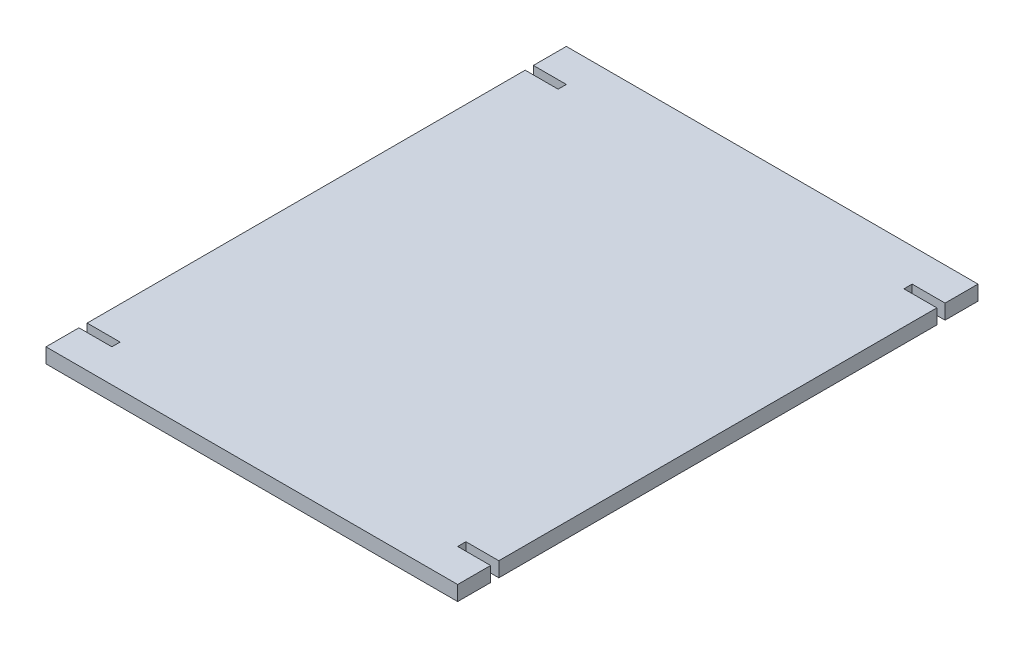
ISO-10303-21;
HEADER;
FILE_DESCRIPTION(('STEP AP214'),'2;1');
FILE_NAME('part.step','',(''),(''),'','','');
FILE_SCHEMA(('AUTOMOTIVE_DESIGN { 1 0 10303 214 1 1 1 1 }'));
ENDSEC;
DATA;
#1=APPLICATION_CONTEXT('core data for automotive mechanical design processes');
#2=APPLICATION_PROTOCOL_DEFINITION('international standard','automotive_design',2000,#1);
#3=PRODUCT_CONTEXT('',#1,'mechanical');
#4=PRODUCT('Part','Part','',(#3));
#5=PRODUCT_RELATED_PRODUCT_CATEGORY('part','',(#4));
#6=PRODUCT_DEFINITION_FORMATION('','',#4);
#7=PRODUCT_DEFINITION_CONTEXT('part definition',#1,'design');
#8=PRODUCT_DEFINITION('design','',#6,#7);
#9=PRODUCT_DEFINITION_SHAPE('','',#8);
#10=(LENGTH_UNIT() NAMED_UNIT(*) SI_UNIT(.MILLI.,.METRE.));
#11=(NAMED_UNIT(*) PLANE_ANGLE_UNIT() SI_UNIT($,.RADIAN.));
#12=(NAMED_UNIT(*) SI_UNIT($,.STERADIAN.) SOLID_ANGLE_UNIT());
#13=UNCERTAINTY_MEASURE_WITH_UNIT(LENGTH_MEASURE(1.E-05),#10,'distance_accuracy_value','');
#14=(GEOMETRIC_REPRESENTATION_CONTEXT(3) GLOBAL_UNCERTAINTY_ASSIGNED_CONTEXT((#13)) GLOBAL_UNIT_ASSIGNED_CONTEXT((#10,
#11,#12)) REPRESENTATION_CONTEXT('',''));
#15=CARTESIAN_POINT('',(0.,0.,0.));
#16=DIRECTION('',(0.,0.,1.));
#17=DIRECTION('',(1.,0.,0.));
#18=AXIS2_PLACEMENT_3D('',#15,#16,#17);
#19=CARTESIAN_POINT('',(-301.875,18.,-168.229166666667));
#20=DIRECTION('',(1.,0.,0.));
#21=DIRECTION('',(0.,0.,-1.));
#22=AXIS2_PLACEMENT_3D('',#19,#20,#21);
#23=PLANE('',#22);
#24=DIRECTION('',(0.,0.,1.));
#25=VECTOR('',#24,1.);
#26=CARTESIAN_POINT('',(-301.875,0.,-168.229166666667));
#27=LINE('',#26,#25);
#28=CARTESIAN_POINT('',(-301.875,0.,-208.229166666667));
#29=VERTEX_POINT('',#28);
#30=CARTESIAN_POINT('',(-301.875,0.,-168.229166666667));
#31=VERTEX_POINT('',#30);
#32=EDGE_CURVE('E201',#29,#31,#27,.T.);
#33=ORIENTED_EDGE('',*,*,#32,.T.);
#34=DIRECTION('',(0.,-1.,0.));
#35=VECTOR('',#34,1.);
#36=CARTESIAN_POINT('',(-301.875,18.,-168.229166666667));
#37=LINE('',#36,#35);
#38=CARTESIAN_POINT('',(-301.875,18.,-168.229166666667));
#39=VERTEX_POINT('',#38);
#40=EDGE_CURVE('E11',#39,#31,#37,.T.);
#41=ORIENTED_EDGE('',*,*,#40,.F.);
#42=DIRECTION('',(0.,0.,1.));
#43=VECTOR('',#42,1.);
#44=CARTESIAN_POINT('',(-301.875,18.,-168.229166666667));
#45=LINE('',#44,#43);
#46=CARTESIAN_POINT('',(-301.875,18.,-208.229166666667));
#47=VERTEX_POINT('',#46);
#48=EDGE_CURVE('E239',#47,#39,#45,.T.);
#49=ORIENTED_EDGE('',*,*,#48,.F.);
#50=DIRECTION('',(0.,-1.,0.));
#51=VECTOR('',#50,1.);
#52=CARTESIAN_POINT('',(-301.875,18.,-208.229166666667));
#53=LINE('',#52,#51);
#54=EDGE_CURVE('E197',#47,#29,#53,.T.);
#55=ORIENTED_EDGE('',*,*,#54,.T.);
#56=EDGE_LOOP('',(#33,#41,#49,#55));
#57=FACE_BOUND('',#56,.T.);
#58=ADVANCED_FACE('F33',(#57),#23,.F.);
#59=CARTESIAN_POINT('',(-261.875,18.,-168.229166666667));
#60=DIRECTION('',(0.,0.,-1.));
#61=DIRECTION('',(-1.,0.,0.));
#62=AXIS2_PLACEMENT_3D('',#59,#60,#61);
#63=PLANE('',#62);
#64=DIRECTION('',(1.,0.,0.));
#65=VECTOR('',#64,1.);
#66=CARTESIAN_POINT('',(-261.875,0.,-168.229166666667));
#67=LINE('',#66,#65);
#68=CARTESIAN_POINT('',(-261.875,0.,-168.229166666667));
#69=VERTEX_POINT('',#68);
#70=EDGE_CURVE('E204',#31,#69,#67,.T.);
#71=ORIENTED_EDGE('',*,*,#70,.T.);
#72=DIRECTION('',(0.,-1.,0.));
#73=VECTOR('',#72,1.);
#74=CARTESIAN_POINT('',(-261.875,18.,-168.229166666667));
#75=LINE('',#74,#73);
#76=CARTESIAN_POINT('',(-261.875,18.,-168.229166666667));
#77=VERTEX_POINT('',#76);
#78=EDGE_CURVE('E41',#77,#69,#75,.T.);
#79=ORIENTED_EDGE('',*,*,#78,.F.);
#80=DIRECTION('',(1.,0.,0.));
#81=VECTOR('',#80,1.);
#82=CARTESIAN_POINT('',(-261.875,18.,-168.229166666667));
#83=LINE('',#82,#81);
#84=EDGE_CURVE('E128',#39,#77,#83,.T.);
#85=ORIENTED_EDGE('',*,*,#84,.F.);
#86=ORIENTED_EDGE('',*,*,#40,.T.);
#87=EDGE_LOOP('',(#71,#79,#85,#86));
#88=FACE_BOUND('',#87,.T.);
#89=ADVANCED_FACE('F357',(#88),#63,.F.);
#90=CARTESIAN_POINT('',(-261.875,18.,-158.229166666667));
#91=DIRECTION('',(1.,0.,0.));
#92=DIRECTION('',(0.,0.,-1.));
#93=AXIS2_PLACEMENT_3D('',#90,#91,#92);
#94=PLANE('',#93);
#95=DIRECTION('',(0.,0.,1.));
#96=VECTOR('',#95,1.);
#97=CARTESIAN_POINT('',(-261.875,0.,-158.229166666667));
#98=LINE('',#97,#96);
#99=CARTESIAN_POINT('',(-261.875,0.,-158.229166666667));
#100=VERTEX_POINT('',#99);
#101=EDGE_CURVE('E206',#69,#100,#98,.T.);
#102=ORIENTED_EDGE('',*,*,#101,.T.);
#103=DIRECTION('',(0.,-1.,0.));
#104=VECTOR('',#103,1.);
#105=CARTESIAN_POINT('',(-261.875,18.,-158.229166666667));
#106=LINE('',#105,#104);
#107=CARTESIAN_POINT('',(-261.875,18.,-158.229166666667));
#108=VERTEX_POINT('',#107);
#109=EDGE_CURVE('E282',#108,#100,#106,.T.);
#110=ORIENTED_EDGE('',*,*,#109,.F.);
#111=DIRECTION('',(0.,0.,1.));
#112=VECTOR('',#111,1.);
#113=CARTESIAN_POINT('',(-261.875,18.,-158.229166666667));
#114=LINE('',#113,#112);
#115=EDGE_CURVE('E290',#77,#108,#114,.T.);
#116=ORIENTED_EDGE('',*,*,#115,.F.);
#117=ORIENTED_EDGE('',*,*,#78,.T.);
#118=EDGE_LOOP('',(#102,#110,#116,#117));
#119=FACE_BOUND('',#118,.T.);
#120=ADVANCED_FACE('F288',(#119),#94,.F.);
#121=CARTESIAN_POINT('',(-301.875,18.,-158.229166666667));
#122=DIRECTION('',(0.,0.,1.));
#123=DIRECTION('',(1.,0.,0.));
#124=AXIS2_PLACEMENT_3D('',#121,#122,#123);
#125=PLANE('',#124);
#126=DIRECTION('',(-1.,0.,0.));
#127=VECTOR('',#126,1.);
#128=CARTESIAN_POINT('',(-301.875,0.,-158.229166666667));
#129=LINE('',#128,#127);
#130=CARTESIAN_POINT('',(-301.875,0.,-158.229166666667));
#131=VERTEX_POINT('',#130);
#132=EDGE_CURVE('E208',#100,#131,#129,.T.);
#133=ORIENTED_EDGE('',*,*,#132,.T.);
#134=DIRECTION('',(0.,-1.,0.));
#135=VECTOR('',#134,1.);
#136=CARTESIAN_POINT('',(-301.875,18.,-158.229166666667));
#137=LINE('',#136,#135);
#138=CARTESIAN_POINT('',(-301.875,18.,-158.229166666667));
#139=VERTEX_POINT('',#138);
#140=EDGE_CURVE('E279',#139,#131,#137,.T.);
#141=ORIENTED_EDGE('',*,*,#140,.F.);
#142=DIRECTION('',(-1.,0.,0.));
#143=VECTOR('',#142,1.);
#144=CARTESIAN_POINT('',(-301.875,18.,-158.229166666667));
#145=LINE('',#144,#143);
#146=EDGE_CURVE('E308',#108,#139,#145,.T.);
#147=ORIENTED_EDGE('',*,*,#146,.F.);
#148=ORIENTED_EDGE('',*,*,#109,.T.);
#149=EDGE_LOOP('',(#133,#141,#147,#148));
#150=FACE_BOUND('',#149,.T.);
#151=ADVANCED_FACE('F299',(#150),#125,.F.);
#152=CARTESIAN_POINT('',(-301.875,18.,373.770833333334));
#153=DIRECTION('',(1.,0.,0.));
#154=DIRECTION('',(0.,0.,-1.));
#155=AXIS2_PLACEMENT_3D('',#152,#153,#154);
#156=PLANE('',#155);
#157=DIRECTION('',(0.,0.,1.));
#158=VECTOR('',#157,1.);
#159=CARTESIAN_POINT('',(-301.875,0.,373.770833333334));
#160=LINE('',#159,#158);
#161=CARTESIAN_POINT('',(-301.875,0.,373.770833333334));
#162=VERTEX_POINT('',#161);
#163=EDGE_CURVE('E210',#131,#162,#160,.T.);
#164=ORIENTED_EDGE('',*,*,#163,.T.);
#165=DIRECTION('',(0.,-1.,0.));
#166=VECTOR('',#165,1.);
#167=CARTESIAN_POINT('',(-301.875,18.,373.770833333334));
#168=LINE('',#167,#166);
#169=CARTESIAN_POINT('',(-301.875,18.,373.770833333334));
#170=VERTEX_POINT('',#169);
#171=EDGE_CURVE('E276',#170,#162,#168,.T.);
#172=ORIENTED_EDGE('',*,*,#171,.F.);
#173=DIRECTION('',(0.,0.,1.));
#174=VECTOR('',#173,1.);
#175=CARTESIAN_POINT('',(-301.875,18.,373.770833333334));
#176=LINE('',#175,#174);
#177=EDGE_CURVE('E305',#139,#170,#176,.T.);
#178=ORIENTED_EDGE('',*,*,#177,.F.);
#179=ORIENTED_EDGE('',*,*,#140,.T.);
#180=EDGE_LOOP('',(#164,#172,#178,#179));
#181=FACE_BOUND('',#180,.T.);
#182=ADVANCED_FACE('F303',(#181),#156,.F.);
#183=CARTESIAN_POINT('',(-261.875,18.,373.770833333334));
#184=DIRECTION('',(0.,0.,-1.));
#185=DIRECTION('',(-1.,0.,0.));
#186=AXIS2_PLACEMENT_3D('',#183,#184,#185);
#187=PLANE('',#186);
#188=DIRECTION('',(1.,0.,0.));
#189=VECTOR('',#188,1.);
#190=CARTESIAN_POINT('',(-261.875,0.,373.770833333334));
#191=LINE('',#190,#189);
#192=CARTESIAN_POINT('',(-261.875,0.,373.770833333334));
#193=VERTEX_POINT('',#192);
#194=EDGE_CURVE('E212',#162,#193,#191,.T.);
#195=ORIENTED_EDGE('',*,*,#194,.T.);
#196=DIRECTION('',(0.,-1.,0.));
#197=VECTOR('',#196,1.);
#198=CARTESIAN_POINT('',(-261.875,18.,373.770833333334));
#199=LINE('',#198,#197);
#200=CARTESIAN_POINT('',(-261.875,18.,373.770833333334));
#201=VERTEX_POINT('',#200);
#202=EDGE_CURVE('E273',#201,#193,#199,.T.);
#203=ORIENTED_EDGE('',*,*,#202,.F.);
#204=DIRECTION('',(1.,0.,0.));
#205=VECTOR('',#204,1.);
#206=CARTESIAN_POINT('',(-261.875,18.,373.770833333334));
#207=LINE('',#206,#205);
#208=EDGE_CURVE('E307',#170,#201,#207,.T.);
#209=ORIENTED_EDGE('',*,*,#208,.F.);
#210=ORIENTED_EDGE('',*,*,#171,.T.);
#211=EDGE_LOOP('',(#195,#203,#209,#210));
#212=FACE_BOUND('',#211,.T.);
#213=ADVANCED_FACE('F370',(#212),#187,.F.);
#214=CARTESIAN_POINT('',(-261.875,18.,383.770833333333));
#215=DIRECTION('',(1.,0.,0.));
#216=DIRECTION('',(0.,0.,-1.));
#217=AXIS2_PLACEMENT_3D('',#214,#215,#216);
#218=PLANE('',#217);
#219=DIRECTION('',(0.,0.,1.));
#220=VECTOR('',#219,1.);
#221=CARTESIAN_POINT('',(-261.875,0.,383.770833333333));
#222=LINE('',#221,#220);
#223=CARTESIAN_POINT('',(-261.875,0.,383.770833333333));
#224=VERTEX_POINT('',#223);
#225=EDGE_CURVE('E214',#193,#224,#222,.T.);
#226=ORIENTED_EDGE('',*,*,#225,.T.);
#227=DIRECTION('',(0.,-1.,0.));
#228=VECTOR('',#227,1.);
#229=CARTESIAN_POINT('',(-261.875,18.,383.770833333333));
#230=LINE('',#229,#228);
#231=CARTESIAN_POINT('',(-261.875,18.,383.770833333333));
#232=VERTEX_POINT('',#231);
#233=EDGE_CURVE('E270',#232,#224,#230,.T.);
#234=ORIENTED_EDGE('',*,*,#233,.F.);
#235=DIRECTION('',(0.,0.,1.));
#236=VECTOR('',#235,1.);
#237=CARTESIAN_POINT('',(-261.875,18.,383.770833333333));
#238=LINE('',#237,#236);
#239=EDGE_CURVE('E310',#201,#232,#238,.T.);
#240=ORIENTED_EDGE('',*,*,#239,.F.);
#241=ORIENTED_EDGE('',*,*,#202,.T.);
#242=EDGE_LOOP('',(#226,#234,#240,#241));
#243=FACE_BOUND('',#242,.T.);
#244=ADVANCED_FACE('F373',(#243),#218,.F.);
#245=CARTESIAN_POINT('',(-301.875,18.,383.770833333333));
#246=DIRECTION('',(0.,0.,1.));
#247=DIRECTION('',(1.,0.,0.));
#248=AXIS2_PLACEMENT_3D('',#245,#246,#247);
#249=PLANE('',#248);
#250=DIRECTION('',(-1.,0.,0.));
#251=VECTOR('',#250,1.);
#252=CARTESIAN_POINT('',(-301.875,0.,383.770833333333));
#253=LINE('',#252,#251);
#254=CARTESIAN_POINT('',(-301.875,0.,383.770833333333));
#255=VERTEX_POINT('',#254);
#256=EDGE_CURVE('E216',#224,#255,#253,.T.);
#257=ORIENTED_EDGE('',*,*,#256,.T.);
#258=DIRECTION('',(0.,-1.,0.));
#259=VECTOR('',#258,1.);
#260=CARTESIAN_POINT('',(-301.875,18.,383.770833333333));
#261=LINE('',#260,#259);
#262=CARTESIAN_POINT('',(-301.875,18.,383.770833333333));
#263=VERTEX_POINT('',#262);
#264=EDGE_CURVE('E267',#263,#255,#261,.T.);
#265=ORIENTED_EDGE('',*,*,#264,.F.);
#266=DIRECTION('',(-1.,0.,0.));
#267=VECTOR('',#266,1.);
#268=CARTESIAN_POINT('',(-301.875,18.,383.770833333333));
#269=LINE('',#268,#267);
#270=EDGE_CURVE('E316',#232,#263,#269,.T.);
#271=ORIENTED_EDGE('',*,*,#270,.F.);
#272=ORIENTED_EDGE('',*,*,#233,.T.);
#273=EDGE_LOOP('',(#257,#265,#271,#272));
#274=FACE_BOUND('',#273,.T.);
#275=ADVANCED_FACE('F377',(#274),#249,.F.);
#276=CARTESIAN_POINT('',(-301.875,18.,423.770833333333));
#277=DIRECTION('',(1.,0.,0.));
#278=DIRECTION('',(0.,0.,-1.));
#279=AXIS2_PLACEMENT_3D('',#276,#277,#278);
#280=PLANE('',#279);
#281=DIRECTION('',(0.,0.,1.));
#282=VECTOR('',#281,1.);
#283=CARTESIAN_POINT('',(-301.875,0.,423.770833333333));
#284=LINE('',#283,#282);
#285=CARTESIAN_POINT('',(-301.875,0.,423.770833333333));
#286=VERTEX_POINT('',#285);
#287=EDGE_CURVE('E218',#255,#286,#284,.T.);
#288=ORIENTED_EDGE('',*,*,#287,.T.);
#289=DIRECTION('',(0.,-1.,0.));
#290=VECTOR('',#289,1.);
#291=CARTESIAN_POINT('',(-301.875,18.,423.770833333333));
#292=LINE('',#291,#290);
#293=CARTESIAN_POINT('',(-301.875,18.,423.770833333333));
#294=VERTEX_POINT('',#293);
#295=EDGE_CURVE('E264',#294,#286,#292,.T.);
#296=ORIENTED_EDGE('',*,*,#295,.F.);
#297=DIRECTION('',(0.,0.,1.));
#298=VECTOR('',#297,1.);
#299=CARTESIAN_POINT('',(-301.875,18.,423.770833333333));
#300=LINE('',#299,#298);
#301=EDGE_CURVE('E318',#263,#294,#300,.T.);
#302=ORIENTED_EDGE('',*,*,#301,.F.);
#303=ORIENTED_EDGE('',*,*,#264,.T.);
#304=EDGE_LOOP('',(#288,#296,#302,#303));
#305=FACE_BOUND('',#304,.T.);
#306=ADVANCED_FACE('F381',(#305),#280,.F.);
#307=CARTESIAN_POINT('',(198.125,18.,423.770833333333));
#308=DIRECTION('',(0.,0.,-1.));
#309=DIRECTION('',(-1.,0.,0.));
#310=AXIS2_PLACEMENT_3D('',#307,#308,#309);
#311=PLANE('',#310);
#312=DIRECTION('',(1.,0.,0.));
#313=VECTOR('',#312,1.);
#314=CARTESIAN_POINT('',(198.125,0.,423.770833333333));
#315=LINE('',#314,#313);
#316=CARTESIAN_POINT('',(198.125,0.,423.770833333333));
#317=VERTEX_POINT('',#316);
#318=EDGE_CURVE('E220',#286,#317,#315,.T.);
#319=ORIENTED_EDGE('',*,*,#318,.T.);
#320=DIRECTION('',(0.,-1.,0.));
#321=VECTOR('',#320,1.);
#322=CARTESIAN_POINT('',(198.125,18.,423.770833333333));
#323=LINE('',#322,#321);
#324=CARTESIAN_POINT('',(198.125,18.,423.770833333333));
#325=VERTEX_POINT('',#324);
#326=EDGE_CURVE('E261',#325,#317,#323,.T.);
#327=ORIENTED_EDGE('',*,*,#326,.F.);
#328=DIRECTION('',(1.,0.,0.));
#329=VECTOR('',#328,1.);
#330=CARTESIAN_POINT('',(198.125,18.,423.770833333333));
#331=LINE('',#330,#329);
#332=EDGE_CURVE('E320',#294,#325,#331,.T.);
#333=ORIENTED_EDGE('',*,*,#332,.F.);
#334=ORIENTED_EDGE('',*,*,#295,.T.);
#335=EDGE_LOOP('',(#319,#327,#333,#334));
#336=FACE_BOUND('',#335,.T.);
#337=ADVANCED_FACE('F385',(#336),#311,.F.);
#338=CARTESIAN_POINT('',(198.125,18.,383.770833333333));
#339=DIRECTION('',(-1.,0.,0.));
#340=DIRECTION('',(0.,0.,1.));
#341=AXIS2_PLACEMENT_3D('',#338,#339,#340);
#342=PLANE('',#341);
#343=DIRECTION('',(0.,0.,-1.));
#344=VECTOR('',#343,1.);
#345=CARTESIAN_POINT('',(198.125,0.,383.770833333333));
#346=LINE('',#345,#344);
#347=CARTESIAN_POINT('',(198.125,0.,383.770833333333));
#348=VERTEX_POINT('',#347);
#349=EDGE_CURVE('E222',#317,#348,#346,.T.);
#350=ORIENTED_EDGE('',*,*,#349,.T.);
#351=DIRECTION('',(0.,-1.,0.));
#352=VECTOR('',#351,1.);
#353=CARTESIAN_POINT('',(198.125,18.,383.770833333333));
#354=LINE('',#353,#352);
#355=CARTESIAN_POINT('',(198.125,18.,383.770833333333));
#356=VERTEX_POINT('',#355);
#357=EDGE_CURVE('E258',#356,#348,#354,.T.);
#358=ORIENTED_EDGE('',*,*,#357,.F.);
#359=DIRECTION('',(0.,0.,-1.));
#360=VECTOR('',#359,1.);
#361=CARTESIAN_POINT('',(198.125,18.,383.770833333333));
#362=LINE('',#361,#360);
#363=EDGE_CURVE('E322',#325,#356,#362,.T.);
#364=ORIENTED_EDGE('',*,*,#363,.F.);
#365=ORIENTED_EDGE('',*,*,#326,.T.);
#366=EDGE_LOOP('',(#350,#358,#364,#365));
#367=FACE_BOUND('',#366,.T.);
#368=ADVANCED_FACE('F389',(#367),#342,.F.);
#369=CARTESIAN_POINT('',(158.125,18.,383.770833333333));
#370=DIRECTION('',(0.,0.,1.));
#371=DIRECTION('',(1.,0.,0.));
#372=AXIS2_PLACEMENT_3D('',#369,#370,#371);
#373=PLANE('',#372);
#374=DIRECTION('',(-1.,0.,0.));
#375=VECTOR('',#374,1.);
#376=CARTESIAN_POINT('',(158.125,0.,383.770833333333));
#377=LINE('',#376,#375);
#378=CARTESIAN_POINT('',(158.125,0.,383.770833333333));
#379=VERTEX_POINT('',#378);
#380=EDGE_CURVE('E224',#348,#379,#377,.T.);
#381=ORIENTED_EDGE('',*,*,#380,.T.);
#382=DIRECTION('',(0.,-1.,0.));
#383=VECTOR('',#382,1.);
#384=CARTESIAN_POINT('',(158.125,18.,383.770833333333));
#385=LINE('',#384,#383);
#386=CARTESIAN_POINT('',(158.125,18.,383.770833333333));
#387=VERTEX_POINT('',#386);
#388=EDGE_CURVE('E255',#387,#379,#385,.T.);
#389=ORIENTED_EDGE('',*,*,#388,.F.);
#390=DIRECTION('',(-1.,0.,0.));
#391=VECTOR('',#390,1.);
#392=CARTESIAN_POINT('',(158.125,18.,383.770833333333));
#393=LINE('',#392,#391);
#394=EDGE_CURVE('E324',#356,#387,#393,.T.);
#395=ORIENTED_EDGE('',*,*,#394,.F.);
#396=ORIENTED_EDGE('',*,*,#357,.T.);
#397=EDGE_LOOP('',(#381,#389,#395,#396));
#398=FACE_BOUND('',#397,.T.);
#399=ADVANCED_FACE('F393',(#398),#373,.F.);
#400=CARTESIAN_POINT('',(158.125,18.,373.770833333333));
#401=DIRECTION('',(-1.,0.,0.));
#402=DIRECTION('',(0.,0.,1.));
#403=AXIS2_PLACEMENT_3D('',#400,#401,#402);
#404=PLANE('',#403);
#405=DIRECTION('',(0.,0.,-1.));
#406=VECTOR('',#405,1.);
#407=CARTESIAN_POINT('',(158.125,0.,373.770833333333));
#408=LINE('',#407,#406);
#409=CARTESIAN_POINT('',(158.125,0.,373.770833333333));
#410=VERTEX_POINT('',#409);
#411=EDGE_CURVE('E226',#379,#410,#408,.T.);
#412=ORIENTED_EDGE('',*,*,#411,.T.);
#413=DIRECTION('',(0.,-1.,0.));
#414=VECTOR('',#413,1.);
#415=CARTESIAN_POINT('',(158.125,18.,373.770833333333));
#416=LINE('',#415,#414);
#417=CARTESIAN_POINT('',(158.125,18.,373.770833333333));
#418=VERTEX_POINT('',#417);
#419=EDGE_CURVE('E252',#418,#410,#416,.T.);
#420=ORIENTED_EDGE('',*,*,#419,.F.);
#421=DIRECTION('',(0.,0.,-1.));
#422=VECTOR('',#421,1.);
#423=CARTESIAN_POINT('',(158.125,18.,373.770833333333));
#424=LINE('',#423,#422);
#425=EDGE_CURVE('E326',#387,#418,#424,.T.);
#426=ORIENTED_EDGE('',*,*,#425,.F.);
#427=ORIENTED_EDGE('',*,*,#388,.T.);
#428=EDGE_LOOP('',(#412,#420,#426,#427));
#429=FACE_BOUND('',#428,.T.);
#430=ADVANCED_FACE('F397',(#429),#404,.F.);
#431=CARTESIAN_POINT('',(198.125,18.,373.770833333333));
#432=DIRECTION('',(0.,0.,-1.));
#433=DIRECTION('',(-1.,0.,0.));
#434=AXIS2_PLACEMENT_3D('',#431,#432,#433);
#435=PLANE('',#434);
#436=DIRECTION('',(1.,0.,0.));
#437=VECTOR('',#436,1.);
#438=CARTESIAN_POINT('',(198.125,0.,373.770833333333));
#439=LINE('',#438,#437);
#440=CARTESIAN_POINT('',(198.125,0.,373.770833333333));
#441=VERTEX_POINT('',#440);
#442=EDGE_CURVE('E228',#410,#441,#439,.T.);
#443=ORIENTED_EDGE('',*,*,#442,.T.);
#444=DIRECTION('',(0.,-1.,0.));
#445=VECTOR('',#444,1.);
#446=CARTESIAN_POINT('',(198.125,18.,373.770833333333));
#447=LINE('',#446,#445);
#448=CARTESIAN_POINT('',(198.125,18.,373.770833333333));
#449=VERTEX_POINT('',#448);
#450=EDGE_CURVE('E249',#449,#441,#447,.T.);
#451=ORIENTED_EDGE('',*,*,#450,.F.);
#452=DIRECTION('',(1.,0.,0.));
#453=VECTOR('',#452,1.);
#454=CARTESIAN_POINT('',(198.125,18.,373.770833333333));
#455=LINE('',#454,#453);
#456=EDGE_CURVE('E328',#418,#449,#455,.T.);
#457=ORIENTED_EDGE('',*,*,#456,.F.);
#458=ORIENTED_EDGE('',*,*,#419,.T.);
#459=EDGE_LOOP('',(#443,#451,#457,#458));
#460=FACE_BOUND('',#459,.T.);
#461=ADVANCED_FACE('F401',(#460),#435,.F.);
#462=CARTESIAN_POINT('',(198.125,18.,-158.229166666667));
#463=DIRECTION('',(-1.,0.,0.));
#464=DIRECTION('',(0.,0.,1.));
#465=AXIS2_PLACEMENT_3D('',#462,#463,#464);
#466=PLANE('',#465);
#467=DIRECTION('',(0.,0.,-1.));
#468=VECTOR('',#467,1.);
#469=CARTESIAN_POINT('',(198.125,0.,-158.229166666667));
#470=LINE('',#469,#468);
#471=CARTESIAN_POINT('',(198.125,0.,-158.229166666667));
#472=VERTEX_POINT('',#471);
#473=EDGE_CURVE('E230',#441,#472,#470,.T.);
#474=ORIENTED_EDGE('',*,*,#473,.T.);
#475=DIRECTION('',(0.,-1.,0.));
#476=VECTOR('',#475,1.);
#477=CARTESIAN_POINT('',(198.125,18.,-158.229166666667));
#478=LINE('',#477,#476);
#479=CARTESIAN_POINT('',(198.125,18.,-158.229166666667));
#480=VERTEX_POINT('',#479);
#481=EDGE_CURVE('E246',#480,#472,#478,.T.);
#482=ORIENTED_EDGE('',*,*,#481,.F.);
#483=DIRECTION('',(0.,0.,-1.));
#484=VECTOR('',#483,1.);
#485=CARTESIAN_POINT('',(198.125,18.,-158.229166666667));
#486=LINE('',#485,#484);
#487=EDGE_CURVE('E330',#449,#480,#486,.T.);
#488=ORIENTED_EDGE('',*,*,#487,.F.);
#489=ORIENTED_EDGE('',*,*,#450,.T.);
#490=EDGE_LOOP('',(#474,#482,#488,#489));
#491=FACE_BOUND('',#490,.T.);
#492=ADVANCED_FACE('F405',(#491),#466,.F.);
#493=CARTESIAN_POINT('',(158.125,18.,-158.229166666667));
#494=DIRECTION('',(0.,0.,1.));
#495=DIRECTION('',(1.,0.,0.));
#496=AXIS2_PLACEMENT_3D('',#493,#494,#495);
#497=PLANE('',#496);
#498=DIRECTION('',(-1.,0.,0.));
#499=VECTOR('',#498,1.);
#500=CARTESIAN_POINT('',(158.125,0.,-158.229166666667));
#501=LINE('',#500,#499);
#502=CARTESIAN_POINT('',(158.125,0.,-158.229166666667));
#503=VERTEX_POINT('',#502);
#504=EDGE_CURVE('E232',#472,#503,#501,.T.);
#505=ORIENTED_EDGE('',*,*,#504,.T.);
#506=DIRECTION('',(0.,-1.,0.));
#507=VECTOR('',#506,1.);
#508=CARTESIAN_POINT('',(158.125,18.,-158.229166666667));
#509=LINE('',#508,#507);
#510=CARTESIAN_POINT('',(158.125,18.,-158.229166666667));
#511=VERTEX_POINT('',#510);
#512=EDGE_CURVE('E243',#511,#503,#509,.T.);
#513=ORIENTED_EDGE('',*,*,#512,.F.);
#514=DIRECTION('',(-1.,0.,0.));
#515=VECTOR('',#514,1.);
#516=CARTESIAN_POINT('',(158.125,18.,-158.229166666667));
#517=LINE('',#516,#515);
#518=EDGE_CURVE('E332',#480,#511,#517,.T.);
#519=ORIENTED_EDGE('',*,*,#518,.F.);
#520=ORIENTED_EDGE('',*,*,#481,.T.);
#521=EDGE_LOOP('',(#505,#513,#519,#520));
#522=FACE_BOUND('',#521,.T.);
#523=ADVANCED_FACE('F338',(#522),#497,.F.);
#524=CARTESIAN_POINT('',(158.125,18.,-168.229166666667));
#525=DIRECTION('',(-1.,0.,0.));
#526=DIRECTION('',(0.,0.,1.));
#527=AXIS2_PLACEMENT_3D('',#524,#525,#526);
#528=PLANE('',#527);
#529=DIRECTION('',(0.,0.,-1.));
#530=VECTOR('',#529,1.);
#531=CARTESIAN_POINT('',(158.125,0.,-168.229166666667));
#532=LINE('',#531,#530);
#533=CARTESIAN_POINT('',(158.125,0.,-168.229166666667));
#534=VERTEX_POINT('',#533);
#535=EDGE_CURVE('E234',#503,#534,#532,.T.);
#536=ORIENTED_EDGE('',*,*,#535,.T.);
#537=DIRECTION('',(0.,-1.,0.));
#538=VECTOR('',#537,1.);
#539=CARTESIAN_POINT('',(158.125,18.,-168.229166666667));
#540=LINE('',#539,#538);
#541=CARTESIAN_POINT('',(158.125,18.,-168.229166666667));
#542=VERTEX_POINT('',#541);
#543=EDGE_CURVE('E192',#542,#534,#540,.T.);
#544=ORIENTED_EDGE('',*,*,#543,.F.);
#545=DIRECTION('',(0.,0.,-1.));
#546=VECTOR('',#545,1.);
#547=CARTESIAN_POINT('',(158.125,18.,-168.229166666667));
#548=LINE('',#547,#546);
#549=EDGE_CURVE('E183',#511,#542,#548,.T.);
#550=ORIENTED_EDGE('',*,*,#549,.F.);
#551=ORIENTED_EDGE('',*,*,#512,.T.);
#552=EDGE_LOOP('',(#536,#544,#550,#551));
#553=FACE_BOUND('',#552,.T.);
#554=ADVANCED_FACE('F342',(#553),#528,.F.);
#555=CARTESIAN_POINT('',(198.125,18.,-168.229166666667));
#556=DIRECTION('',(0.,0.,-1.));
#557=DIRECTION('',(-1.,0.,0.));
#558=AXIS2_PLACEMENT_3D('',#555,#556,#557);
#559=PLANE('',#558);
#560=DIRECTION('',(1.,0.,0.));
#561=VECTOR('',#560,1.);
#562=CARTESIAN_POINT('',(198.125,0.,-168.229166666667));
#563=LINE('',#562,#561);
#564=CARTESIAN_POINT('',(198.125,0.,-168.229166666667));
#565=VERTEX_POINT('',#564);
#566=EDGE_CURVE('E191',#534,#565,#563,.T.);
#567=ORIENTED_EDGE('',*,*,#566,.T.);
#568=DIRECTION('',(0.,-1.,0.));
#569=VECTOR('',#568,1.);
#570=CARTESIAN_POINT('',(198.125,18.,-168.229166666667));
#571=LINE('',#570,#569);
#572=CARTESIAN_POINT('',(198.125,18.,-168.229166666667));
#573=VERTEX_POINT('',#572);
#574=EDGE_CURVE('E188',#573,#565,#571,.T.);
#575=ORIENTED_EDGE('',*,*,#574,.F.);
#576=DIRECTION('',(1.,0.,0.));
#577=VECTOR('',#576,1.);
#578=CARTESIAN_POINT('',(198.125,18.,-168.229166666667));
#579=LINE('',#578,#577);
#580=EDGE_CURVE('E177',#542,#573,#579,.T.);
#581=ORIENTED_EDGE('',*,*,#580,.F.);
#582=ORIENTED_EDGE('',*,*,#543,.T.);
#583=EDGE_LOOP('',(#567,#575,#581,#582));
#584=FACE_BOUND('',#583,.T.);
#585=ADVANCED_FACE('F189',(#584),#559,.F.);
#586=CARTESIAN_POINT('',(198.125,18.,-208.229166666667));
#587=DIRECTION('',(-1.,0.,0.));
#588=DIRECTION('',(0.,0.,1.));
#589=AXIS2_PLACEMENT_3D('',#586,#587,#588);
#590=PLANE('',#589);
#591=DIRECTION('',(0.,0.,-1.));
#592=VECTOR('',#591,1.);
#593=CARTESIAN_POINT('',(198.125,0.,-208.229166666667));
#594=LINE('',#593,#592);
#595=CARTESIAN_POINT('',(198.125,0.,-208.229166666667));
#596=VERTEX_POINT('',#595);
#597=EDGE_CURVE('E114',#565,#596,#594,.T.);
#598=ORIENTED_EDGE('',*,*,#597,.T.);
#599=DIRECTION('',(0.,-1.,0.));
#600=VECTOR('',#599,1.);
#601=CARTESIAN_POINT('',(198.125,18.,-208.229166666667));
#602=LINE('',#601,#600);
#603=CARTESIAN_POINT('',(198.125,18.,-208.229166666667));
#604=VERTEX_POINT('',#603);
#605=EDGE_CURVE('E193',#604,#596,#602,.T.);
#606=ORIENTED_EDGE('',*,*,#605,.F.);
#607=DIRECTION('',(0.,0.,-1.));
#608=VECTOR('',#607,1.);
#609=CARTESIAN_POINT('',(198.125,18.,-208.229166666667));
#610=LINE('',#609,#608);
#611=EDGE_CURVE('E181',#573,#604,#610,.T.);
#612=ORIENTED_EDGE('',*,*,#611,.F.);
#613=ORIENTED_EDGE('',*,*,#574,.T.);
#614=EDGE_LOOP('',(#598,#606,#612,#613));
#615=FACE_BOUND('',#614,.T.);
#616=ADVANCED_FACE('F195',(#615),#590,.F.);
#617=CARTESIAN_POINT('',(-301.875,18.,-208.229166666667));
#618=DIRECTION('',(0.,0.,1.));
#619=DIRECTION('',(1.,0.,0.));
#620=AXIS2_PLACEMENT_3D('',#617,#618,#619);
#621=PLANE('',#620);
#622=DIRECTION('',(-1.,0.,0.));
#623=VECTOR('',#622,1.);
#624=CARTESIAN_POINT('',(-301.875,0.,-208.229166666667));
#625=LINE('',#624,#623);
#626=EDGE_CURVE('E120',#596,#29,#625,.T.);
#627=ORIENTED_EDGE('',*,*,#626,.T.);
#628=ORIENTED_EDGE('',*,*,#54,.F.);
#629=DIRECTION('',(-1.,0.,0.));
#630=VECTOR('',#629,1.);
#631=CARTESIAN_POINT('',(-301.875,18.,-208.229166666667));
#632=LINE('',#631,#630);
#633=EDGE_CURVE('E49',#604,#47,#632,.T.);
#634=ORIENTED_EDGE('',*,*,#633,.F.);
#635=ORIENTED_EDGE('',*,*,#605,.T.);
#636=EDGE_LOOP('',(#627,#628,#634,#635));
#637=FACE_BOUND('',#636,.T.);
#638=ADVANCED_FACE('F346',(#637),#621,.F.);
#639=CARTESIAN_POINT('',(0.,18.,0.));
#640=DIRECTION('',(0.,-1.,0.));
#641=DIRECTION('',(0.,0.,-1.));
#642=AXIS2_PLACEMENT_3D('',#639,#640,#641);
#643=PLANE('',#642);
#644=ORIENTED_EDGE('',*,*,#48,.T.);
#645=ORIENTED_EDGE('',*,*,#84,.T.);
#646=ORIENTED_EDGE('',*,*,#115,.T.);
#647=ORIENTED_EDGE('',*,*,#146,.T.);
#648=ORIENTED_EDGE('',*,*,#177,.T.);
#649=ORIENTED_EDGE('',*,*,#208,.T.);
#650=ORIENTED_EDGE('',*,*,#239,.T.);
#651=ORIENTED_EDGE('',*,*,#270,.T.);
#652=ORIENTED_EDGE('',*,*,#301,.T.);
#653=ORIENTED_EDGE('',*,*,#332,.T.);
#654=ORIENTED_EDGE('',*,*,#363,.T.);
#655=ORIENTED_EDGE('',*,*,#394,.T.);
#656=ORIENTED_EDGE('',*,*,#425,.T.);
#657=ORIENTED_EDGE('',*,*,#456,.T.);
#658=ORIENTED_EDGE('',*,*,#487,.T.);
#659=ORIENTED_EDGE('',*,*,#518,.T.);
#660=ORIENTED_EDGE('',*,*,#549,.T.);
#661=ORIENTED_EDGE('',*,*,#580,.T.);
#662=ORIENTED_EDGE('',*,*,#611,.T.);
#663=ORIENTED_EDGE('',*,*,#633,.T.);
#664=EDGE_LOOP('',(#644,#645,#646,#647,#648,#649,#650,#651,#652,#653,#654,#655,#656,#657,#658,
#659,#660,#661,#662,#663));
#665=FACE_BOUND('',#664,.T.);
#666=ADVANCED_FACE('F179',(#665),#643,.F.);
#667=CARTESIAN_POINT('',(0.,0.,0.));
#668=DIRECTION('',(0.,-1.,0.));
#669=DIRECTION('',(0.,0.,-1.));
#670=AXIS2_PLACEMENT_3D('',#667,#668,#669);
#671=PLANE('',#670);
#672=ORIENTED_EDGE('',*,*,#32,.F.);
#673=ORIENTED_EDGE('',*,*,#626,.F.);
#674=ORIENTED_EDGE('',*,*,#597,.F.);
#675=ORIENTED_EDGE('',*,*,#566,.F.);
#676=ORIENTED_EDGE('',*,*,#535,.F.);
#677=ORIENTED_EDGE('',*,*,#504,.F.);
#678=ORIENTED_EDGE('',*,*,#473,.F.);
#679=ORIENTED_EDGE('',*,*,#442,.F.);
#680=ORIENTED_EDGE('',*,*,#411,.F.);
#681=ORIENTED_EDGE('',*,*,#380,.F.);
#682=ORIENTED_EDGE('',*,*,#349,.F.);
#683=ORIENTED_EDGE('',*,*,#318,.F.);
#684=ORIENTED_EDGE('',*,*,#287,.F.);
#685=ORIENTED_EDGE('',*,*,#256,.F.);
#686=ORIENTED_EDGE('',*,*,#225,.F.);
#687=ORIENTED_EDGE('',*,*,#194,.F.);
#688=ORIENTED_EDGE('',*,*,#163,.F.);
#689=ORIENTED_EDGE('',*,*,#132,.F.);
#690=ORIENTED_EDGE('',*,*,#101,.F.);
#691=ORIENTED_EDGE('',*,*,#70,.F.);
#692=EDGE_LOOP('',(#672,#673,#674,#675,#676,#677,#678,#679,#680,#681,#682,#683,#684,#685,#686,
#687,#688,#689,#690,#691));
#693=FACE_BOUND('',#692,.T.);
#694=ADVANCED_FACE('F294',(#693),#671,.T.);
#695=CLOSED_SHELL('',(#58,#89,#120,#151,#182,#213,#244,#275,#306,#337,#368,#399,#430,#461,#492,
#523,#554,#585,#616,#638,#666,#694));
#696=MANIFOLD_SOLID_BREP('B2',#695);
#697=ADVANCED_BREP_SHAPE_REPRESENTATION('',(#18,#696),#14);
#698=SHAPE_DEFINITION_REPRESENTATION(#9,#697);
ENDSEC;
END-ISO-10303-21;
